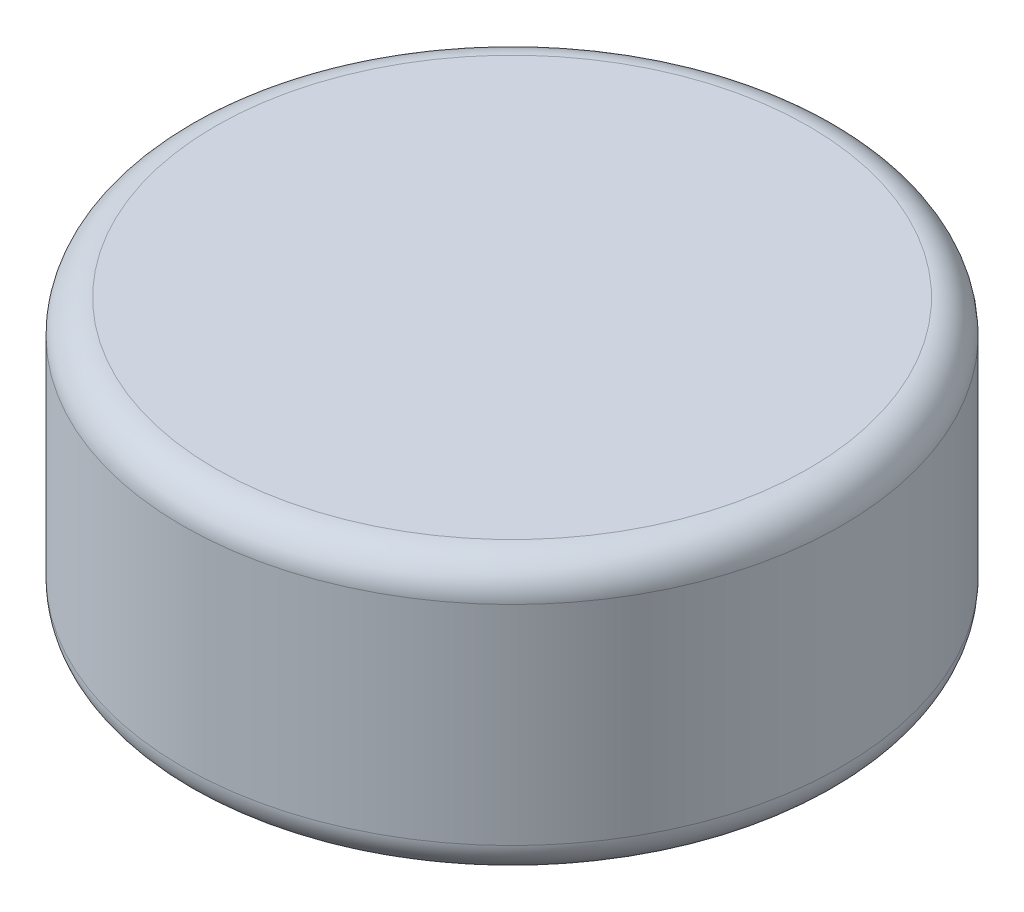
ISO-10303-21;
HEADER;
FILE_DESCRIPTION(('STEP AP214'),'2;1');
FILE_NAME('part.step','',(''),(''),'','','');
FILE_SCHEMA(('AUTOMOTIVE_DESIGN { 1 0 10303 214 1 1 1 1 }'));
ENDSEC;
DATA;
#1=APPLICATION_CONTEXT('core data for automotive mechanical design processes');
#2=APPLICATION_PROTOCOL_DEFINITION('international standard','automotive_design',2000,#1);
#3=PRODUCT_CONTEXT('',#1,'mechanical');
#4=PRODUCT('Part','Part','',(#3));
#5=PRODUCT_RELATED_PRODUCT_CATEGORY('part','',(#4));
#6=PRODUCT_DEFINITION_FORMATION('','',#4);
#7=PRODUCT_DEFINITION_CONTEXT('part definition',#1,'design');
#8=PRODUCT_DEFINITION('design','',#6,#7);
#9=PRODUCT_DEFINITION_SHAPE('','',#8);
#10=(LENGTH_UNIT() NAMED_UNIT(*) SI_UNIT(.MILLI.,.METRE.));
#11=(NAMED_UNIT(*) PLANE_ANGLE_UNIT() SI_UNIT($,.RADIAN.));
#12=(NAMED_UNIT(*) SI_UNIT($,.STERADIAN.) SOLID_ANGLE_UNIT());
#13=UNCERTAINTY_MEASURE_WITH_UNIT(LENGTH_MEASURE(1.E-05),#10,'distance_accuracy_value','');
#14=(GEOMETRIC_REPRESENTATION_CONTEXT(3) GLOBAL_UNCERTAINTY_ASSIGNED_CONTEXT((#13)) GLOBAL_UNIT_ASSIGNED_CONTEXT((#10,
#11,#12)) REPRESENTATION_CONTEXT('',''));
#15=CARTESIAN_POINT('',(0.,0.,0.));
#16=DIRECTION('',(0.,0.,1.));
#17=DIRECTION('',(1.,0.,0.));
#18=AXIS2_PLACEMENT_3D('',#15,#16,#17);
#19=CARTESIAN_POINT('',(0.,2.5,0.));
#20=DIRECTION('',(0.,-1.,0.));
#21=DIRECTION('',(0.,0.,-1.));
#22=AXIS2_PLACEMENT_3D('',#19,#20,#21);
#23=CYLINDRICAL_SURFACE('',#22,3.);
#24=CARTESIAN_POINT('',(0.,2.2,0.));
#25=DIRECTION('',(0.,1.,0.));
#26=DIRECTION('',(0.,0.,1.));
#27=AXIS2_PLACEMENT_3D('',#24,#25,#26);
#28=CIRCLE('',#27,3.);
#29=CARTESIAN_POINT('',(0.,2.2,3.));
#30=VERTEX_POINT('',#29);
#31=EDGE_CURVE('E44',#30,#30,#28,.F.);
#32=ORIENTED_EDGE('',*,*,#31,.T.);
#33=EDGE_LOOP('',(#32));
#34=FACE_BOUND('',#33,.T.);
#35=CARTESIAN_POINT('',(0.,0.3,0.));
#36=DIRECTION('',(0.,1.,0.));
#37=DIRECTION('',(0.,0.,1.));
#38=AXIS2_PLACEMENT_3D('',#35,#36,#37);
#39=CIRCLE('',#38,3.);
#40=CARTESIAN_POINT('',(0.,0.3,3.));
#41=VERTEX_POINT('',#40);
#42=EDGE_CURVE('E48',#41,#41,#39,.T.);
#43=ORIENTED_EDGE('',*,*,#42,.T.);
#44=EDGE_LOOP('',(#43));
#45=FACE_BOUND('',#44,.T.);
#46=ADVANCED_FACE('F37',(#34,#45),#23,.T.);
#47=CARTESIAN_POINT('',(0.,2.5,0.));
#48=DIRECTION('',(0.,1.,0.));
#49=DIRECTION('',(0.,0.,1.));
#50=AXIS2_PLACEMENT_3D('',#47,#48,#49);
#51=PLANE('',#50);
#52=CARTESIAN_POINT('',(0.,2.5,0.));
#53=DIRECTION('',(0.,1.,0.));
#54=DIRECTION('',(0.,0.,1.));
#55=AXIS2_PLACEMENT_3D('',#52,#53,#54);
#56=CIRCLE('',#55,2.7);
#57=CARTESIAN_POINT('',(0.,2.5,2.7));
#58=VERTEX_POINT('',#57);
#59=EDGE_CURVE('E52',#58,#58,#56,.T.);
#60=ORIENTED_EDGE('',*,*,#59,.T.);
#61=EDGE_LOOP('',(#60));
#62=FACE_BOUND('',#61,.T.);
#63=ADVANCED_FACE('F58',(#62),#51,.T.);
#64=CARTESIAN_POINT('',(0.,0.,0.));
#65=DIRECTION('',(0.,1.,0.));
#66=DIRECTION('',(0.,0.,1.));
#67=AXIS2_PLACEMENT_3D('',#64,#65,#66);
#68=PLANE('',#67);
#69=CARTESIAN_POINT('',(0.,0.,0.));
#70=DIRECTION('',(0.,1.,0.));
#71=DIRECTION('',(0.,0.,1.));
#72=AXIS2_PLACEMENT_3D('',#69,#70,#71);
#73=CIRCLE('',#72,2.7);
#74=CARTESIAN_POINT('',(0.,0.,2.7));
#75=VERTEX_POINT('',#74);
#76=EDGE_CURVE('E10',#75,#75,#73,.F.);
#77=ORIENTED_EDGE('',*,*,#76,.T.);
#78=EDGE_LOOP('',(#77));
#79=FACE_BOUND('',#78,.T.);
#80=ADVANCED_FACE('F62',(#79),#68,.F.);
#81=CARTESIAN_POINT('',(0.,2.2,0.));
#82=DIRECTION('',(0.,1.,0.));
#83=DIRECTION('',(0.,0.,1.));
#84=AXIS2_PLACEMENT_3D('',#81,#82,#83);
#85=TOROIDAL_SURFACE('',#84,2.7,0.3);
#86=ORIENTED_EDGE('',*,*,#31,.F.);
#87=EDGE_LOOP('',(#86));
#88=FACE_BOUND('',#87,.T.);
#89=ORIENTED_EDGE('',*,*,#59,.F.);
#90=EDGE_LOOP('',(#89));
#91=FACE_BOUND('',#90,.T.);
#92=ADVANCED_FACE('F60',(#88,#91),#85,.T.);
#93=CARTESIAN_POINT('',(0.,0.3,0.));
#94=DIRECTION('',(0.,1.,0.));
#95=DIRECTION('',(0.,0.,1.));
#96=AXIS2_PLACEMENT_3D('',#93,#94,#95);
#97=TOROIDAL_SURFACE('',#96,2.7,0.3);
#98=ORIENTED_EDGE('',*,*,#76,.F.);
#99=EDGE_LOOP('',(#98));
#100=FACE_BOUND('',#99,.T.);
#101=ORIENTED_EDGE('',*,*,#42,.F.);
#102=EDGE_LOOP('',(#101));
#103=FACE_BOUND('',#102,.T.);
#104=ADVANCED_FACE('F39',(#100,#103),#97,.T.);
#105=CLOSED_SHELL('',(#46,#63,#80,#92,#104));
#106=MANIFOLD_SOLID_BREP('B2',#105);
#107=ADVANCED_BREP_SHAPE_REPRESENTATION('',(#18,#106),#14);
#108=SHAPE_DEFINITION_REPRESENTATION(#9,#107);
ENDSEC;
END-ISO-10303-21;
